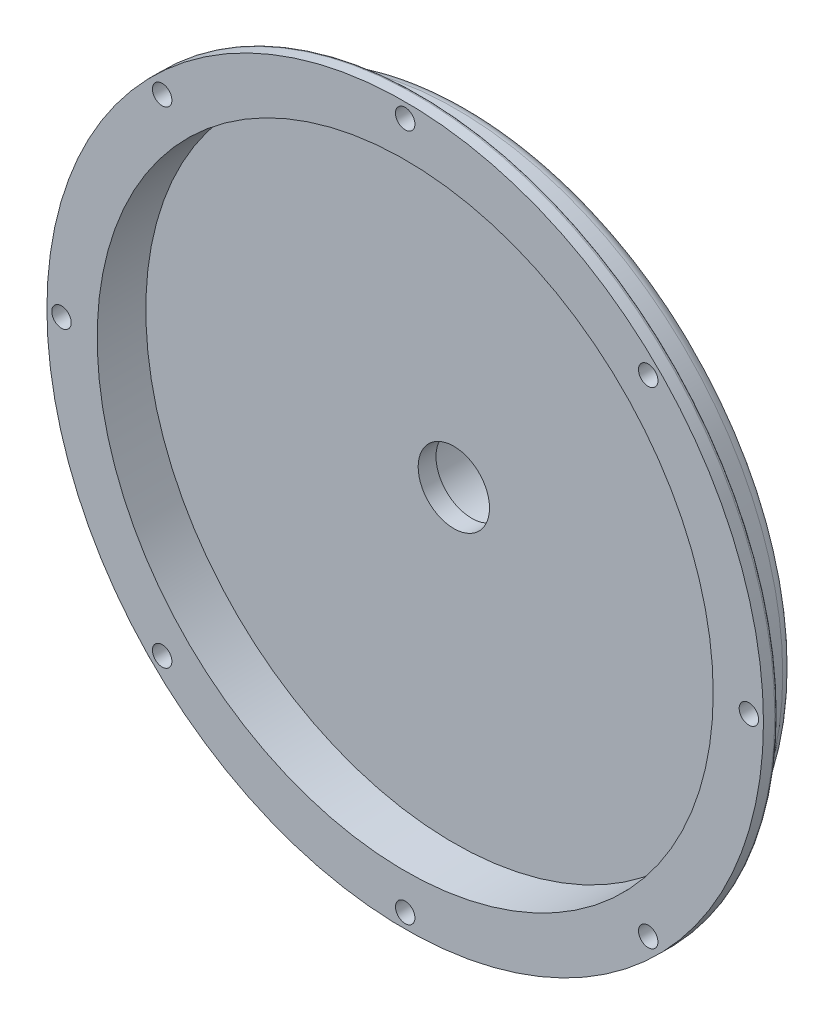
ISO-10303-21;
HEADER;
FILE_DESCRIPTION(('STEP AP214'),'2;1');
FILE_NAME('part.step','',(''),(''),'','','');
FILE_SCHEMA(('AUTOMOTIVE_DESIGN { 1 0 10303 214 1 1 1 1 }'));
ENDSEC;
DATA;
#1=APPLICATION_CONTEXT('core data for automotive mechanical design processes');
#2=APPLICATION_PROTOCOL_DEFINITION('international standard','automotive_design',2000,#1);
#3=PRODUCT_CONTEXT('',#1,'mechanical');
#4=PRODUCT('Part','Part','',(#3));
#5=PRODUCT_RELATED_PRODUCT_CATEGORY('part','',(#4));
#6=PRODUCT_DEFINITION_FORMATION('','',#4);
#7=PRODUCT_DEFINITION_CONTEXT('part definition',#1,'design');
#8=PRODUCT_DEFINITION('design','',#6,#7);
#9=PRODUCT_DEFINITION_SHAPE('','',#8);
#10=(LENGTH_UNIT() NAMED_UNIT(*) SI_UNIT(.MILLI.,.METRE.));
#11=(NAMED_UNIT(*) PLANE_ANGLE_UNIT() SI_UNIT($,.RADIAN.));
#12=(NAMED_UNIT(*) SI_UNIT($,.STERADIAN.) SOLID_ANGLE_UNIT());
#13=UNCERTAINTY_MEASURE_WITH_UNIT(LENGTH_MEASURE(1.E-05),#10,'distance_accuracy_value','');
#14=(GEOMETRIC_REPRESENTATION_CONTEXT(3) GLOBAL_UNCERTAINTY_ASSIGNED_CONTEXT((#13)) GLOBAL_UNIT_ASSIGNED_CONTEXT((#10,
#11,#12)) REPRESENTATION_CONTEXT('',''));
#15=CARTESIAN_POINT('',(0.,0.,0.));
#16=DIRECTION('',(0.,0.,1.));
#17=DIRECTION('',(1.,0.,0.));
#18=AXIS2_PLACEMENT_3D('',#15,#16,#17);
#19=CARTESIAN_POINT('',(0.,0.,-40.));
#20=DIRECTION('',(0.,0.,-1.));
#21=DIRECTION('',(-1.,0.,0.));
#22=AXIS2_PLACEMENT_3D('',#19,#20,#21);
#23=PLANE('',#22);
#24=CARTESIAN_POINT('',(0.,0.,-40.));
#25=DIRECTION('',(0.,0.,-1.));
#26=DIRECTION('',(-1.,0.,0.));
#27=AXIS2_PLACEMENT_3D('',#24,#25,#26);
#28=CIRCLE('',#27,15.);
#29=CARTESIAN_POINT('',(-15.,0.,-40.));
#30=VERTEX_POINT('',#29);
#31=EDGE_CURVE('E134',#30,#30,#28,.T.);
#32=ORIENTED_EDGE('',*,*,#31,.F.);
#33=EDGE_LOOP('',(#32));
#34=FACE_BOUND('',#33,.T.);
#35=CARTESIAN_POINT('',(0.,0.,-40.));
#36=DIRECTION('',(0.,0.,-1.));
#37=DIRECTION('',(-1.,0.,0.));
#38=AXIS2_PLACEMENT_3D('',#35,#36,#37);
#39=CIRCLE('',#38,16.2921591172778);
#40=CARTESIAN_POINT('',(-16.2921591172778,0.,-40.));
#41=VERTEX_POINT('',#40);
#42=EDGE_CURVE('E147',#41,#41,#39,.F.);
#43=ORIENTED_EDGE('',*,*,#42,.F.);
#44=EDGE_LOOP('',(#43));
#45=FACE_BOUND('',#44,.T.);
#46=ADVANCED_FACE('F31',(#34,#45),#23,.T.);
#47=CARTESIAN_POINT('',(0.,0.,-40.));
#48=DIRECTION('',(0.,0.,1.));
#49=DIRECTION('',(1.,0.,0.));
#50=AXIS2_PLACEMENT_3D('',#47,#48,#49);
#51=CYLINDRICAL_SURFACE('',#50,17.);
#52=CARTESIAN_POINT('',(0.,0.,-25.5));
#53=DIRECTION('',(0.,0.,1.));
#54=DIRECTION('',(1.,0.,0.));
#55=AXIS2_PLACEMENT_3D('',#52,#53,#54);
#56=CIRCLE('',#55,17.);
#57=CARTESIAN_POINT('',(17.,0.,-25.5));
#58=VERTEX_POINT('',#57);
#59=EDGE_CURVE('E48',#58,#58,#56,.F.);
#60=CARTESIAN_POINT('',(0.,0.,-27.));
#61=DIRECTION('',(0.,0.,-1.));
#62=DIRECTION('',(-1.,0.,0.));
#63=AXIS2_PLACEMENT_3D('',#60,#61,#62);
#64=CIRCLE('',#63,17.);
#65=CARTESIAN_POINT('',(17.,0.,-27.));
#66=VERTEX_POINT('',#65);
#67=EDGE_CURVE('E10',#66,#66,#64,.T.);
#68=CARTESIAN_POINT('',(17.,0.,-25.5));
#69=CARTESIAN_POINT('',(17.,0.,-25.515625));
#70=CARTESIAN_POINT('',(17.,0.,-25.53125));
#71=CARTESIAN_POINT('',(17.,0.,-25.5625));
#72=CARTESIAN_POINT('',(17.,0.,-25.578125));
#73=CARTESIAN_POINT('',(17.,0.,-25.609375));
#74=CARTESIAN_POINT('',(17.,0.,-25.625));
#75=CARTESIAN_POINT('',(17.,0.,-25.65625));
#76=CARTESIAN_POINT('',(17.,0.,-25.671875));
#77=CARTESIAN_POINT('',(17.,0.,-25.703125));
#78=CARTESIAN_POINT('',(17.,0.,-25.71875));
#79=CARTESIAN_POINT('',(17.,0.,-25.75));
#80=CARTESIAN_POINT('',(17.,0.,-25.765625));
#81=CARTESIAN_POINT('',(17.,0.,-25.796875));
#82=CARTESIAN_POINT('',(17.,0.,-25.8125));
#83=CARTESIAN_POINT('',(17.,0.,-25.84375));
#84=CARTESIAN_POINT('',(17.,0.,-25.859375));
#85=CARTESIAN_POINT('',(17.,0.,-25.890625));
#86=CARTESIAN_POINT('',(17.,0.,-25.90625));
#87=CARTESIAN_POINT('',(17.,0.,-25.9375));
#88=CARTESIAN_POINT('',(17.,0.,-25.953125));
#89=CARTESIAN_POINT('',(17.,0.,-25.984375));
#90=CARTESIAN_POINT('',(17.,0.,-26.));
#91=CARTESIAN_POINT('',(17.,0.,-26.03125));
#92=CARTESIAN_POINT('',(17.,0.,-26.046875));
#93=CARTESIAN_POINT('',(17.,0.,-26.078125));
#94=CARTESIAN_POINT('',(17.,0.,-26.09375));
#95=CARTESIAN_POINT('',(17.,0.,-26.125));
#96=CARTESIAN_POINT('',(17.,0.,-26.140625));
#97=CARTESIAN_POINT('',(17.,0.,-26.171875));
#98=CARTESIAN_POINT('',(17.,0.,-26.1875));
#99=CARTESIAN_POINT('',(17.,0.,-26.21875));
#100=CARTESIAN_POINT('',(17.,0.,-26.234375));
#101=CARTESIAN_POINT('',(17.,0.,-26.265625));
#102=CARTESIAN_POINT('',(17.,0.,-26.28125));
#103=CARTESIAN_POINT('',(17.,0.,-26.3125));
#104=CARTESIAN_POINT('',(17.,0.,-26.328125));
#105=CARTESIAN_POINT('',(17.,0.,-26.359375));
#106=CARTESIAN_POINT('',(17.,0.,-26.375));
#107=CARTESIAN_POINT('',(17.,0.,-26.40625));
#108=CARTESIAN_POINT('',(17.,0.,-26.421875));
#109=CARTESIAN_POINT('',(17.,0.,-26.453125));
#110=CARTESIAN_POINT('',(17.,0.,-26.46875));
#111=CARTESIAN_POINT('',(17.,0.,-26.5));
#112=CARTESIAN_POINT('',(17.,0.,-26.515625));
#113=CARTESIAN_POINT('',(17.,0.,-26.546875));
#114=CARTESIAN_POINT('',(17.,0.,-26.5625));
#115=CARTESIAN_POINT('',(17.,0.,-26.59375));
#116=CARTESIAN_POINT('',(17.,0.,-26.609375));
#117=CARTESIAN_POINT('',(17.,0.,-26.640625));
#118=CARTESIAN_POINT('',(17.,0.,-26.65625));
#119=CARTESIAN_POINT('',(17.,0.,-26.6875));
#120=CARTESIAN_POINT('',(17.,0.,-26.703125));
#121=CARTESIAN_POINT('',(17.,0.,-26.734375));
#122=CARTESIAN_POINT('',(17.,0.,-26.75));
#123=CARTESIAN_POINT('',(17.,0.,-26.78125));
#124=CARTESIAN_POINT('',(17.,0.,-26.796875));
#125=CARTESIAN_POINT('',(17.,0.,-26.828125));
#126=CARTESIAN_POINT('',(17.,0.,-26.84375));
#127=CARTESIAN_POINT('',(17.,0.,-26.875));
#128=CARTESIAN_POINT('',(17.,0.,-26.890625));
#129=CARTESIAN_POINT('',(17.,0.,-26.921875));
#130=CARTESIAN_POINT('',(17.,0.,-26.9375));
#131=CARTESIAN_POINT('',(17.,0.,-26.96875));
#132=CARTESIAN_POINT('',(17.,0.,-26.984375));
#133=CARTESIAN_POINT('',(17.,0.,-27.));
#134=B_SPLINE_CURVE_WITH_KNOTS('',3,(#68,#69,#70,#71,#72,#73,#74,#75,#76,#77,#78,#79,#80,#81,
#82,#83,#84,#85,#86,#87,#88,#89,#90,#91,#92,#93,#94,#95,#96,#97,#98,#99,#100,#101,#102,#103,
#104,#105,#106,#107,#108,#109,#110,#111,#112,#113,#114,#115,#116,#117,#118,#119,#120,#121,#122,
#123,#124,#125,#126,#127,#128,#129,#130,#131,#132,#133),.UNSPECIFIED.,.F.,.F.,(4,2,2,2,2,2,2,2,
2,2,2,2,2,2,2,2,2,2,2,2,2,2,2,2,2,2,2,2,2,2,2,2,4),(0.,0.0468750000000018,0.0937500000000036,
0.140625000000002,0.1875,0.234375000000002,0.281250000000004,0.328125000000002,0.375,
0.421875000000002,0.46875,0.515624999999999,0.5625,0.609375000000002,0.656250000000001,
0.703124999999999,0.750000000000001,0.796875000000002,0.843750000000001,0.890624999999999,
0.937500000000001,0.984375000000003,1.03125,1.078125,1.125,1.171875,1.21875,1.265625,1.3125,
1.359375,1.40625,1.453125,1.5),.UNSPECIFIED.);
#135=EDGE_CURVE('BSEAM170',#58,#66,#134,.T.);
#136=ORIENTED_EDGE('',*,*,#59,.T.);
#137=ORIENTED_EDGE('',*,*,#67,.F.);
#138=ORIENTED_EDGE('',*,*,#135,.T.);
#139=ORIENTED_EDGE('',*,*,#135,.F.);
#140=EDGE_LOOP('',(#136,#138,#137,#139));
#141=FACE_BOUND('',#140,.T.);
#142=ADVANCED_FACE('F170',(#141),#51,.T.);
#143=CARTESIAN_POINT('',(0.,0.,-25.5));
#144=DIRECTION('',(0.,0.,1.));
#145=DIRECTION('',(1.,0.,0.));
#146=AXIS2_PLACEMENT_3D('',#143,#144,#145);
#147=PLANE('',#146);
#148=CARTESIAN_POINT('',(0.,0.,-25.5));
#149=DIRECTION('',(0.,0.,1.));
#150=DIRECTION('',(1.,0.,0.));
#151=AXIS2_PLACEMENT_3D('',#148,#149,#150);
#152=CIRCLE('',#151,25.5);
#153=CARTESIAN_POINT('',(25.5,0.,-25.5));
#154=VERTEX_POINT('',#153);
#155=EDGE_CURVE('E39',#154,#154,#152,.F.);
#156=ORIENTED_EDGE('',*,*,#155,.T.);
#157=EDGE_LOOP('',(#156));
#158=FACE_BOUND('',#157,.T.);
#159=ORIENTED_EDGE('',*,*,#59,.F.);
#160=EDGE_LOOP('',(#159));
#161=FACE_BOUND('',#160,.T.);
#162=ADVANCED_FACE('F178',(#158,#161),#147,.F.);
#163=CARTESIAN_POINT('',(-110.5,0.,0.));
#164=DIRECTION('',(0.,0.,-1.));
#165=DIRECTION('',(-1.,0.,0.));
#166=AXIS2_PLACEMENT_3D('',#163,#164,#165);
#167=PLANE('',#166);
#168=CARTESIAN_POINT('',(0.,0.,0.));
#169=DIRECTION('',(0.,0.,1.));
#170=DIRECTION('',(1.,0.,0.));
#171=AXIS2_PLACEMENT_3D('',#168,#169,#170);
#172=CIRCLE('',#171,95.);
#173=CARTESIAN_POINT('',(95.,0.,0.));
#174=VERTEX_POINT('',#173);
#175=EDGE_CURVE('E52',#174,#174,#172,.T.);
#176=ORIENTED_EDGE('',*,*,#175,.F.);
#177=EDGE_LOOP('',(#176));
#178=FACE_BOUND('',#177,.T.);
#179=CARTESIAN_POINT('',(0.,106.,0.));
#180=DIRECTION('',(0.,0.,1.));
#181=DIRECTION('',(1.,0.,0.));
#182=AXIS2_PLACEMENT_3D('',#179,#180,#181);
#183=CIRCLE('',#182,3.);
#184=CARTESIAN_POINT('',(3.,106.,0.));
#185=VERTEX_POINT('',#184);
#186=EDGE_CURVE('E82',#185,#185,#183,.T.);
#187=ORIENTED_EDGE('',*,*,#186,.F.);
#188=EDGE_LOOP('',(#187));
#189=FACE_BOUND('',#188,.T.);
#190=CARTESIAN_POINT('',(74.9533188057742,74.9533188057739,0.));
#191=DIRECTION('',(0.,0.,1.));
#192=DIRECTION('',(1.,0.,0.));
#193=AXIS2_PLACEMENT_3D('',#190,#191,#192);
#194=CIRCLE('',#193,2.99999999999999);
#195=CARTESIAN_POINT('',(77.9533188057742,74.9533188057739,0.));
#196=VERTEX_POINT('',#195);
#197=EDGE_CURVE('E127',#196,#196,#194,.T.);
#198=ORIENTED_EDGE('',*,*,#197,.F.);
#199=EDGE_LOOP('',(#198));
#200=FACE_BOUND('',#199,.T.);
#201=CARTESIAN_POINT('',(106.,-3.70097021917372E-13,0.));
#202=DIRECTION('',(0.,0.,1.));
#203=DIRECTION('',(1.,0.,0.));
#204=AXIS2_PLACEMENT_3D('',#201,#202,#203);
#205=CIRCLE('',#204,3.);
#206=CARTESIAN_POINT('',(109.,-3.70097021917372E-13,0.));
#207=VERTEX_POINT('',#206);
#208=EDGE_CURVE('E124',#207,#207,#205,.T.);
#209=ORIENTED_EDGE('',*,*,#208,.F.);
#210=EDGE_LOOP('',(#209));
#211=FACE_BOUND('',#210,.T.);
#212=CARTESIAN_POINT('',(74.9533188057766,-74.953318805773,0.));
#213=DIRECTION('',(0.,0.,1.));
#214=DIRECTION('',(1.,0.,0.));
#215=AXIS2_PLACEMENT_3D('',#212,#213,#214);
#216=CIRCLE('',#215,3.00000000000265);
#217=CARTESIAN_POINT('',(77.9533188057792,-74.953318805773,0.));
#218=VERTEX_POINT('',#217);
#219=EDGE_CURVE('E121',#218,#218,#216,.T.);
#220=ORIENTED_EDGE('',*,*,#219,.F.);
#221=EDGE_LOOP('',(#220));
#222=FACE_BOUND('',#221,.T.);
#223=CARTESIAN_POINT('',(2.9867386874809E-12,-106.,0.));
#224=DIRECTION('',(0.,0.,1.));
#225=DIRECTION('',(1.,0.,0.));
#226=AXIS2_PLACEMENT_3D('',#223,#224,#225);
#227=CIRCLE('',#226,3.00000000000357);
#228=CARTESIAN_POINT('',(3.00000000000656,-106.,0.));
#229=VERTEX_POINT('',#228);
#230=EDGE_CURVE('E118',#229,#229,#227,.T.);
#231=ORIENTED_EDGE('',*,*,#230,.F.);
#232=EDGE_LOOP('',(#231));
#233=FACE_BOUND('',#232,.T.);
#234=CARTESIAN_POINT('',(-74.9533188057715,-74.9533188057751,0.));
#235=DIRECTION('',(0.,0.,1.));
#236=DIRECTION('',(1.,0.,0.));
#237=AXIS2_PLACEMENT_3D('',#234,#235,#236);
#238=CIRCLE('',#237,3.00000000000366);
#239=CARTESIAN_POINT('',(-71.9533188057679,-74.9533188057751,0.));
#240=VERTEX_POINT('',#239);
#241=EDGE_CURVE('E115',#240,#240,#238,.T.);
#242=ORIENTED_EDGE('',*,*,#241,.F.);
#243=EDGE_LOOP('',(#242));
#244=FACE_BOUND('',#243,.T.);
#245=CARTESIAN_POINT('',(-105.999999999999,-1.50635059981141E-12,0.));
#246=DIRECTION('',(0.,0.,1.));
#247=DIRECTION('',(1.,0.,0.));
#248=AXIS2_PLACEMENT_3D('',#245,#246,#247);
#249=CIRCLE('',#248,3.00000000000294);
#250=CARTESIAN_POINT('',(-102.999999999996,-1.50635059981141E-12,0.));
#251=VERTEX_POINT('',#250);
#252=EDGE_CURVE('E111',#251,#251,#249,.T.);
#253=ORIENTED_EDGE('',*,*,#252,.F.);
#254=EDGE_LOOP('',(#253));
#255=FACE_BOUND('',#254,.T.);
#256=CARTESIAN_POINT('',(-74.9533188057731,74.953318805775,0.));
#257=DIRECTION('',(0.,0.,1.));
#258=DIRECTION('',(1.,0.,0.));
#259=AXIS2_PLACEMENT_3D('',#256,#257,#258);
#260=CIRCLE('',#259,3.);
#261=CARTESIAN_POINT('',(-71.9533188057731,74.953318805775,0.));
#262=VERTEX_POINT('',#261);
#263=EDGE_CURVE('E108',#262,#262,#260,.T.);
#264=ORIENTED_EDGE('',*,*,#263,.F.);
#265=EDGE_LOOP('',(#264));
#266=FACE_BOUND('',#265,.T.);
#267=CARTESIAN_POINT('',(0.,0.,0.));
#268=DIRECTION('',(0.,0.,1.));
#269=DIRECTION('',(1.,0.,0.));
#270=AXIS2_PLACEMENT_3D('',#267,#268,#269);
#271=CIRCLE('',#270,110.5);
#272=CARTESIAN_POINT('',(110.5,0.,0.));
#273=VERTEX_POINT('',#272);
#274=EDGE_CURVE('E56',#273,#273,#271,.T.);
#275=ORIENTED_EDGE('',*,*,#274,.T.);
#276=EDGE_LOOP('',(#275));
#277=FACE_BOUND('',#276,.T.);
#278=ADVANCED_FACE('F230',(#178,#189,#200,#211,#222,#233,#244,#255,#266,#277),#167,.F.);
#279=CARTESIAN_POINT('',(0.,0.,0.));
#280=DIRECTION('',(0.,0.,1.));
#281=DIRECTION('',(1.,0.,0.));
#282=AXIS2_PLACEMENT_3D('',#279,#280,#281);
#283=CYLINDRICAL_SURFACE('',#282,110.5);
#284=ORIENTED_EDGE('',*,*,#274,.F.);
#285=EDGE_LOOP('',(#284));
#286=FACE_BOUND('',#285,.T.);
#287=CARTESIAN_POINT('',(0.,0.,-3.49999999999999));
#288=DIRECTION('',(0.,0.,1.));
#289=DIRECTION('',(1.,0.,0.));
#290=AXIS2_PLACEMENT_3D('',#287,#288,#289);
#291=CIRCLE('',#290,110.5);
#292=CARTESIAN_POINT('',(110.5,0.,-3.49999999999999));
#293=VERTEX_POINT('',#292);
#294=EDGE_CURVE('E85',#293,#293,#291,.T.);
#295=ORIENTED_EDGE('',*,*,#294,.T.);
#296=EDGE_LOOP('',(#295));
#297=FACE_BOUND('',#296,.T.);
#298=ADVANCED_FACE('F262',(#286,#297),#283,.T.);
#299=CARTESIAN_POINT('',(0.,0.,-3.49999999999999));
#300=DIRECTION('',(0.,0.,1.));
#301=DIRECTION('',(1.,0.,0.));
#302=AXIS2_PLACEMENT_3D('',#299,#300,#301);
#303=TOROIDAL_SURFACE('',#302,109.5,0.99999999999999);
#304=ORIENTED_EDGE('',*,*,#294,.F.);
#305=EDGE_LOOP('',(#304));
#306=FACE_BOUND('',#305,.T.);
#307=CARTESIAN_POINT('',(0.,0.,-4.49999999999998));
#308=DIRECTION('',(0.,0.,1.));
#309=DIRECTION('',(1.,0.,0.));
#310=AXIS2_PLACEMENT_3D('',#307,#308,#309);
#311=CIRCLE('',#310,109.5);
#312=CARTESIAN_POINT('',(109.5,0.,-4.49999999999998));
#313=VERTEX_POINT('',#312);
#314=EDGE_CURVE('E88',#313,#313,#311,.T.);
#315=ORIENTED_EDGE('',*,*,#314,.T.);
#316=EDGE_LOOP('',(#315));
#317=FACE_BOUND('',#316,.T.);
#318=ADVANCED_FACE('F258',(#306,#317),#303,.T.);
#319=CARTESIAN_POINT('',(-102.462834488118,0.,-4.49999999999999));
#320=DIRECTION('',(0.,0.,1.));
#321=DIRECTION('',(1.,0.,0.));
#322=AXIS2_PLACEMENT_3D('',#319,#320,#321);
#323=PLANE('',#322);
#324=CARTESIAN_POINT('',(0.,106.,-4.49999999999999));
#325=DIRECTION('',(0.,0.,1.));
#326=DIRECTION('',(1.,0.,0.));
#327=AXIS2_PLACEMENT_3D('',#324,#325,#326);
#328=CIRCLE('',#327,3.);
#329=CARTESIAN_POINT('',(3.,106.,-4.49999999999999));
#330=VERTEX_POINT('',#329);
#331=EDGE_CURVE('E57',#330,#330,#328,.T.);
#332=ORIENTED_EDGE('',*,*,#331,.T.);
#333=EDGE_LOOP('',(#332));
#334=FACE_BOUND('',#333,.T.);
#335=CARTESIAN_POINT('',(74.9533188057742,74.9533188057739,-4.49999999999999));
#336=DIRECTION('',(0.,0.,1.));
#337=DIRECTION('',(1.,0.,0.));
#338=AXIS2_PLACEMENT_3D('',#335,#336,#337);
#339=CIRCLE('',#338,2.99999999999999);
#340=CARTESIAN_POINT('',(77.9533188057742,74.9533188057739,-4.49999999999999));
#341=VERTEX_POINT('',#340);
#342=EDGE_CURVE('E61',#341,#341,#339,.T.);
#343=ORIENTED_EDGE('',*,*,#342,.T.);
#344=EDGE_LOOP('',(#343));
#345=FACE_BOUND('',#344,.T.);
#346=CARTESIAN_POINT('',(106.,-3.70097021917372E-13,-4.49999999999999));
#347=DIRECTION('',(0.,0.,1.));
#348=DIRECTION('',(1.,0.,0.));
#349=AXIS2_PLACEMENT_3D('',#346,#347,#348);
#350=CIRCLE('',#349,3.);
#351=CARTESIAN_POINT('',(109.,-3.70097021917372E-13,-4.49999999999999));
#352=VERTEX_POINT('',#351);
#353=EDGE_CURVE('E64',#352,#352,#350,.T.);
#354=ORIENTED_EDGE('',*,*,#353,.T.);
#355=EDGE_LOOP('',(#354));
#356=FACE_BOUND('',#355,.T.);
#357=CARTESIAN_POINT('',(74.9533188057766,-74.953318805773,-4.49999999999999));
#358=DIRECTION('',(0.,0.,1.));
#359=DIRECTION('',(1.,0.,0.));
#360=AXIS2_PLACEMENT_3D('',#357,#358,#359);
#361=CIRCLE('',#360,3.00000000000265);
#362=CARTESIAN_POINT('',(77.9533188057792,-74.953318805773,-4.49999999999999));
#363=VERTEX_POINT('',#362);
#364=EDGE_CURVE('E67',#363,#363,#361,.T.);
#365=ORIENTED_EDGE('',*,*,#364,.T.);
#366=EDGE_LOOP('',(#365));
#367=FACE_BOUND('',#366,.T.);
#368=CARTESIAN_POINT('',(2.9867386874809E-12,-106.,-4.49999999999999));
#369=DIRECTION('',(0.,0.,1.));
#370=DIRECTION('',(1.,0.,0.));
#371=AXIS2_PLACEMENT_3D('',#368,#369,#370);
#372=CIRCLE('',#371,3.00000000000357);
#373=CARTESIAN_POINT('',(3.00000000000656,-106.,-4.49999999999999));
#374=VERTEX_POINT('',#373);
#375=EDGE_CURVE('E70',#374,#374,#372,.T.);
#376=ORIENTED_EDGE('',*,*,#375,.T.);
#377=EDGE_LOOP('',(#376));
#378=FACE_BOUND('',#377,.T.);
#379=CARTESIAN_POINT('',(-74.9533188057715,-74.9533188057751,-4.49999999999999));
#380=DIRECTION('',(0.,0.,1.));
#381=DIRECTION('',(1.,0.,0.));
#382=AXIS2_PLACEMENT_3D('',#379,#380,#381);
#383=CIRCLE('',#382,3.00000000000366);
#384=CARTESIAN_POINT('',(-71.9533188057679,-74.9533188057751,-4.49999999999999));
#385=VERTEX_POINT('',#384);
#386=EDGE_CURVE('E73',#385,#385,#383,.T.);
#387=ORIENTED_EDGE('',*,*,#386,.T.);
#388=EDGE_LOOP('',(#387));
#389=FACE_BOUND('',#388,.T.);
#390=CARTESIAN_POINT('',(-105.999999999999,-1.50635059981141E-12,-4.49999999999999));
#391=DIRECTION('',(0.,0.,1.));
#392=DIRECTION('',(1.,0.,0.));
#393=AXIS2_PLACEMENT_3D('',#390,#391,#392);
#394=CIRCLE('',#393,3.00000000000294);
#395=CARTESIAN_POINT('',(-102.999999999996,-1.50635059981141E-12,-4.49999999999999));
#396=VERTEX_POINT('',#395);
#397=EDGE_CURVE('E76',#396,#396,#394,.T.);
#398=ORIENTED_EDGE('',*,*,#397,.T.);
#399=EDGE_LOOP('',(#398));
#400=FACE_BOUND('',#399,.T.);
#401=CARTESIAN_POINT('',(-74.9533188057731,74.953318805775,-4.49999999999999));
#402=DIRECTION('',(0.,0.,1.));
#403=DIRECTION('',(1.,0.,0.));
#404=AXIS2_PLACEMENT_3D('',#401,#402,#403);
#405=CIRCLE('',#404,3.);
#406=CARTESIAN_POINT('',(-71.9533188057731,74.953318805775,-4.49999999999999));
#407=VERTEX_POINT('',#406);
#408=EDGE_CURVE('E79',#407,#407,#405,.T.);
#409=ORIENTED_EDGE('',*,*,#408,.T.);
#410=EDGE_LOOP('',(#409));
#411=FACE_BOUND('',#410,.T.);
#412=ORIENTED_EDGE('',*,*,#314,.F.);
#413=EDGE_LOOP('',(#412));
#414=FACE_BOUND('',#413,.T.);
#415=CARTESIAN_POINT('',(0.,0.,-4.5));
#416=DIRECTION('',(0.,0.,1.));
#417=DIRECTION('',(1.,0.,0.));
#418=AXIS2_PLACEMENT_3D('',#415,#416,#417);
#419=CIRCLE('',#418,102.462834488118);
#420=CARTESIAN_POINT('',(102.462834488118,0.,-4.5));
#421=VERTEX_POINT('',#420);
#422=EDGE_CURVE('E91',#421,#421,#419,.T.);
#423=ORIENTED_EDGE('',*,*,#422,.T.);
#424=EDGE_LOOP('',(#423));
#425=FACE_BOUND('',#424,.T.);
#426=ADVANCED_FACE('F254',(#334,#345,#356,#367,#378,#389,#400,#411,#414,#425),#323,.F.);
#427=CARTESIAN_POINT('',(0.,0.,-5.5));
#428=DIRECTION('',(0.,0.,1.));
#429=DIRECTION('',(1.,0.,0.));
#430=AXIS2_PLACEMENT_3D('',#427,#428,#429);
#431=TOROIDAL_SURFACE('',#430,102.462834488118,0.999999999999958);
#432=ORIENTED_EDGE('',*,*,#422,.F.);
#433=EDGE_LOOP('',(#432));
#434=FACE_BOUND('',#433,.T.);
#435=CARTESIAN_POINT('',(0.,0.,-5.41940457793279));
#436=DIRECTION('',(0.,0.,1.));
#437=DIRECTION('',(1.,0.,0.));
#438=AXIS2_PLACEMENT_3D('',#435,#436,#437);
#439=CIRCLE('',#438,101.466087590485);
#440=CARTESIAN_POINT('',(101.466087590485,0.,-5.41940457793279));
#441=VERTEX_POINT('',#440);
#442=EDGE_CURVE('E94',#441,#441,#439,.T.);
#443=ORIENTED_EDGE('',*,*,#442,.T.);
#444=EDGE_LOOP('',(#443));
#445=FACE_BOUND('',#444,.T.);
#446=ADVANCED_FACE('F250',(#434,#445),#431,.F.);
#447=CARTESIAN_POINT('',(0.,0.,-15.8223816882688));
#448=DIRECTION('',(0.,0.,1.));
#449=DIRECTION('',(1.,0.,0.));
#450=AXIS2_PLACEMENT_3D('',#447,#448,#449);
#451=CONICAL_SURFACE('',#450,100.624918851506,0.080682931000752);
#452=ORIENTED_EDGE('',*,*,#442,.F.);
#453=EDGE_LOOP('',(#452));
#454=FACE_BOUND('',#453,.T.);
#455=CARTESIAN_POINT('',(0.,0.,-15.8223816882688));
#456=DIRECTION('',(0.,0.,1.));
#457=DIRECTION('',(1.,0.,0.));
#458=AXIS2_PLACEMENT_3D('',#455,#456,#457);
#459=CIRCLE('',#458,100.624918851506);
#460=CARTESIAN_POINT('',(100.624918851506,0.,-15.8223816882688));
#461=VERTEX_POINT('',#460);
#462=EDGE_CURVE('E97',#461,#461,#459,.T.);
#463=ORIENTED_EDGE('',*,*,#462,.T.);
#464=EDGE_LOOP('',(#463));
#465=FACE_BOUND('',#464,.T.);
#466=ADVANCED_FACE('F246',(#454,#465),#451,.T.);
#467=CARTESIAN_POINT('',(0.,0.,-15.5));
#468=DIRECTION('',(0.,0.,1.));
#469=DIRECTION('',(1.,0.,0.));
#470=AXIS2_PLACEMENT_3D('',#467,#468,#469);
#471=TOROIDAL_SURFACE('',#470,96.6379312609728,4.);
#472=ORIENTED_EDGE('',*,*,#462,.F.);
#473=EDGE_LOOP('',(#472));
#474=FACE_BOUND('',#473,.T.);
#475=CARTESIAN_POINT('',(0.,0.,-19.5));
#476=DIRECTION('',(0.,0.,1.));
#477=DIRECTION('',(1.,0.,0.));
#478=AXIS2_PLACEMENT_3D('',#475,#476,#477);
#479=CIRCLE('',#478,96.6379312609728);
#480=CARTESIAN_POINT('',(96.6379312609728,0.,-19.5));
#481=VERTEX_POINT('',#480);
#482=EDGE_CURVE('E100',#481,#481,#479,.T.);
#483=ORIENTED_EDGE('',*,*,#482,.T.);
#484=EDGE_LOOP('',(#483));
#485=FACE_BOUND('',#484,.T.);
#486=ADVANCED_FACE('F242',(#474,#485),#471,.T.);
#487=CARTESIAN_POINT('',(-96.6379312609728,0.,-19.5));
#488=DIRECTION('',(0.,0.,1.));
#489=DIRECTION('',(1.,0.,0.));
#490=AXIS2_PLACEMENT_3D('',#487,#488,#489);
#491=PLANE('',#490);
#492=ORIENTED_EDGE('',*,*,#482,.F.);
#493=EDGE_LOOP('',(#492));
#494=FACE_BOUND('',#493,.T.);
#495=CARTESIAN_POINT('',(0.,0.,-19.5));
#496=DIRECTION('',(0.,0.,1.));
#497=DIRECTION('',(1.,0.,0.));
#498=AXIS2_PLACEMENT_3D('',#495,#496,#497);
#499=CIRCLE('',#498,29.5);
#500=CARTESIAN_POINT('',(29.5,0.,-19.5));
#501=VERTEX_POINT('',#500);
#502=EDGE_CURVE('E103',#501,#501,#499,.T.);
#503=ORIENTED_EDGE('',*,*,#502,.T.);
#504=EDGE_LOOP('',(#503));
#505=FACE_BOUND('',#504,.T.);
#506=ADVANCED_FACE('F238',(#494,#505),#491,.F.);
#507=CARTESIAN_POINT('',(0.,0.,-22.5));
#508=DIRECTION('',(0.,0.,1.));
#509=DIRECTION('',(1.,0.,0.));
#510=AXIS2_PLACEMENT_3D('',#507,#508,#509);
#511=TOROIDAL_SURFACE('',#510,29.5,3.);
#512=ORIENTED_EDGE('',*,*,#502,.F.);
#513=EDGE_LOOP('',(#512));
#514=FACE_BOUND('',#513,.T.);
#515=CARTESIAN_POINT('',(0.,0.,-22.5));
#516=DIRECTION('',(0.,0.,1.));
#517=DIRECTION('',(1.,0.,0.));
#518=AXIS2_PLACEMENT_3D('',#515,#516,#517);
#519=CIRCLE('',#518,26.5);
#520=CARTESIAN_POINT('',(26.5,0.,-22.5));
#521=VERTEX_POINT('',#520);
#522=EDGE_CURVE('E60',#521,#521,#519,.T.);
#523=ORIENTED_EDGE('',*,*,#522,.T.);
#524=EDGE_LOOP('',(#523));
#525=FACE_BOUND('',#524,.T.);
#526=ADVANCED_FACE('F234',(#514,#525),#511,.F.);
#527=CARTESIAN_POINT('',(0.,0.,0.));
#528=DIRECTION('',(0.,0.,1.));
#529=DIRECTION('',(1.,0.,0.));
#530=AXIS2_PLACEMENT_3D('',#527,#528,#529);
#531=CYLINDRICAL_SURFACE('',#530,26.5);
#532=CARTESIAN_POINT('',(0.,0.,-24.5));
#533=DIRECTION('',(0.,0.,1.));
#534=DIRECTION('',(1.,0.,0.));
#535=AXIS2_PLACEMENT_3D('',#532,#533,#534);
#536=CIRCLE('',#535,26.5);
#537=CARTESIAN_POINT('',(26.5,0.,-24.5));
#538=VERTEX_POINT('',#537);
#539=EDGE_CURVE('E43',#538,#538,#536,.T.);
#540=ORIENTED_EDGE('',*,*,#539,.T.);
#541=EDGE_LOOP('',(#540));
#542=FACE_BOUND('',#541,.T.);
#543=ORIENTED_EDGE('',*,*,#522,.F.);
#544=EDGE_LOOP('',(#543));
#545=FACE_BOUND('',#544,.T.);
#546=ADVANCED_FACE('F226',(#542,#545),#531,.T.);
#547=CARTESIAN_POINT('',(-74.9533188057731,74.953318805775,-10.));
#548=DIRECTION('',(0.,0.,1.));
#549=DIRECTION('',(1.,0.,0.));
#550=AXIS2_PLACEMENT_3D('',#547,#548,#549);
#551=CYLINDRICAL_SURFACE('',#550,3.);
#552=ORIENTED_EDGE('',*,*,#263,.T.);
#553=EDGE_LOOP('',(#552));
#554=FACE_BOUND('',#553,.T.);
#555=ORIENTED_EDGE('',*,*,#408,.F.);
#556=EDGE_LOOP('',(#555));
#557=FACE_BOUND('',#556,.T.);
#558=ADVANCED_FACE('F222',(#554,#557),#551,.F.);
#559=CARTESIAN_POINT('',(-105.999999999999,-1.50635059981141E-12,-10.));
#560=DIRECTION('',(0.,0.,1.));
#561=DIRECTION('',(1.,0.,0.));
#562=AXIS2_PLACEMENT_3D('',#559,#560,#561);
#563=CYLINDRICAL_SURFACE('',#562,3.00000000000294);
#564=ORIENTED_EDGE('',*,*,#252,.T.);
#565=EDGE_LOOP('',(#564));
#566=FACE_BOUND('',#565,.T.);
#567=ORIENTED_EDGE('',*,*,#397,.F.);
#568=EDGE_LOOP('',(#567));
#569=FACE_BOUND('',#568,.T.);
#570=ADVANCED_FACE('F218',(#566,#569),#563,.F.);
#571=CARTESIAN_POINT('',(-74.9533188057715,-74.9533188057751,-10.));
#572=DIRECTION('',(0.,0.,1.));
#573=DIRECTION('',(1.,0.,0.));
#574=AXIS2_PLACEMENT_3D('',#571,#572,#573);
#575=CYLINDRICAL_SURFACE('',#574,3.00000000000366);
#576=ORIENTED_EDGE('',*,*,#241,.T.);
#577=EDGE_LOOP('',(#576));
#578=FACE_BOUND('',#577,.T.);
#579=ORIENTED_EDGE('',*,*,#386,.F.);
#580=EDGE_LOOP('',(#579));
#581=FACE_BOUND('',#580,.T.);
#582=ADVANCED_FACE('F214',(#578,#581),#575,.F.);
#583=CARTESIAN_POINT('',(2.9867386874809E-12,-106.,-10.));
#584=DIRECTION('',(0.,0.,1.));
#585=DIRECTION('',(1.,0.,0.));
#586=AXIS2_PLACEMENT_3D('',#583,#584,#585);
#587=CYLINDRICAL_SURFACE('',#586,3.00000000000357);
#588=ORIENTED_EDGE('',*,*,#230,.T.);
#589=EDGE_LOOP('',(#588));
#590=FACE_BOUND('',#589,.T.);
#591=ORIENTED_EDGE('',*,*,#375,.F.);
#592=EDGE_LOOP('',(#591));
#593=FACE_BOUND('',#592,.T.);
#594=ADVANCED_FACE('F210',(#590,#593),#587,.F.);
#595=CARTESIAN_POINT('',(74.9533188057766,-74.953318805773,-10.));
#596=DIRECTION('',(0.,0.,1.));
#597=DIRECTION('',(1.,0.,0.));
#598=AXIS2_PLACEMENT_3D('',#595,#596,#597);
#599=CYLINDRICAL_SURFACE('',#598,3.00000000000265);
#600=ORIENTED_EDGE('',*,*,#219,.T.);
#601=EDGE_LOOP('',(#600));
#602=FACE_BOUND('',#601,.T.);
#603=ORIENTED_EDGE('',*,*,#364,.F.);
#604=EDGE_LOOP('',(#603));
#605=FACE_BOUND('',#604,.T.);
#606=ADVANCED_FACE('F206',(#602,#605),#599,.F.);
#607=CARTESIAN_POINT('',(106.,-3.70097021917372E-13,-10.));
#608=DIRECTION('',(0.,0.,1.));
#609=DIRECTION('',(1.,0.,0.));
#610=AXIS2_PLACEMENT_3D('',#607,#608,#609);
#611=CYLINDRICAL_SURFACE('',#610,3.);
#612=ORIENTED_EDGE('',*,*,#208,.T.);
#613=EDGE_LOOP('',(#612));
#614=FACE_BOUND('',#613,.T.);
#615=ORIENTED_EDGE('',*,*,#353,.F.);
#616=EDGE_LOOP('',(#615));
#617=FACE_BOUND('',#616,.T.);
#618=ADVANCED_FACE('F202',(#614,#617),#611,.F.);
#619=CARTESIAN_POINT('',(74.9533188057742,74.9533188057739,-10.));
#620=DIRECTION('',(0.,0.,1.));
#621=DIRECTION('',(1.,0.,0.));
#622=AXIS2_PLACEMENT_3D('',#619,#620,#621);
#623=CYLINDRICAL_SURFACE('',#622,2.99999999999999);
#624=ORIENTED_EDGE('',*,*,#197,.T.);
#625=EDGE_LOOP('',(#624));
#626=FACE_BOUND('',#625,.T.);
#627=ORIENTED_EDGE('',*,*,#342,.F.);
#628=EDGE_LOOP('',(#627));
#629=FACE_BOUND('',#628,.T.);
#630=ADVANCED_FACE('F198',(#626,#629),#623,.F.);
#631=CARTESIAN_POINT('',(0.,106.,-10.));
#632=DIRECTION('',(0.,0.,1.));
#633=DIRECTION('',(1.,0.,0.));
#634=AXIS2_PLACEMENT_3D('',#631,#632,#633);
#635=CYLINDRICAL_SURFACE('',#634,3.);
#636=ORIENTED_EDGE('',*,*,#186,.T.);
#637=EDGE_LOOP('',(#636));
#638=FACE_BOUND('',#637,.T.);
#639=ORIENTED_EDGE('',*,*,#331,.F.);
#640=EDGE_LOOP('',(#639));
#641=FACE_BOUND('',#640,.T.);
#642=ADVANCED_FACE('F191',(#638,#641),#635,.F.);
#643=CARTESIAN_POINT('',(0.,0.,-20.5));
#644=DIRECTION('',(0.,0.,1.));
#645=DIRECTION('',(1.,0.,0.));
#646=AXIS2_PLACEMENT_3D('',#643,#644,#645);
#647=PLANE('',#646);
#648=CARTESIAN_POINT('',(0.,0.,-20.5));
#649=DIRECTION('',(0.,0.,-1.));
#650=DIRECTION('',(-1.,0.,0.));
#651=AXIS2_PLACEMENT_3D('',#648,#649,#650);
#652=CIRCLE('',#651,11.);
#653=CARTESIAN_POINT('',(-11.,0.,-20.5));
#654=VERTEX_POINT('',#653);
#655=EDGE_CURVE('E53',#654,#654,#652,.T.);
#656=ORIENTED_EDGE('',*,*,#655,.F.);
#657=EDGE_LOOP('',(#656));
#658=FACE_BOUND('',#657,.T.);
#659=CARTESIAN_POINT('',(0.,0.,-20.5));
#660=DIRECTION('',(0.,0.,1.));
#661=DIRECTION('',(1.,0.,0.));
#662=AXIS2_PLACEMENT_3D('',#659,#660,#661);
#663=CIRCLE('',#662,15.);
#664=CARTESIAN_POINT('',(15.,0.,-20.5));
#665=VERTEX_POINT('',#664);
#666=EDGE_CURVE('E112',#665,#665,#663,.T.);
#667=ORIENTED_EDGE('',*,*,#666,.F.);
#668=EDGE_LOOP('',(#667));
#669=FACE_BOUND('',#668,.T.);
#670=ADVANCED_FACE('F187',(#658,#669),#647,.F.);
#671=CARTESIAN_POINT('',(0.,0.,-20.5));
#672=DIRECTION('',(0.,0.,-1.));
#673=DIRECTION('',(-1.,0.,0.));
#674=AXIS2_PLACEMENT_3D('',#671,#672,#673);
#675=CYLINDRICAL_SURFACE('',#674,15.);
#676=ORIENTED_EDGE('',*,*,#666,.T.);
#677=EDGE_LOOP('',(#676));
#678=FACE_BOUND('',#677,.T.);
#679=ORIENTED_EDGE('',*,*,#31,.T.);
#680=EDGE_LOOP('',(#679));
#681=FACE_BOUND('',#680,.T.);
#682=ADVANCED_FACE('F190',(#678,#681),#675,.F.);
#683=CARTESIAN_POINT('',(0.,0.,-15.));
#684=DIRECTION('',(0.,0.,1.));
#685=DIRECTION('',(1.,0.,0.));
#686=AXIS2_PLACEMENT_3D('',#683,#684,#685);
#687=CYLINDRICAL_SURFACE('',#686,95.);
#688=CARTESIAN_POINT('',(0.,0.,-15.));
#689=DIRECTION('',(0.,0.,1.));
#690=DIRECTION('',(1.,0.,0.));
#691=AXIS2_PLACEMENT_3D('',#688,#689,#690);
#692=CIRCLE('',#691,95.);
#693=CARTESIAN_POINT('',(95.,0.,-15.));
#694=VERTEX_POINT('',#693);
#695=EDGE_CURVE('E137',#694,#694,#692,.T.);
#696=ORIENTED_EDGE('',*,*,#695,.F.);
#697=EDGE_LOOP('',(#696));
#698=FACE_BOUND('',#697,.T.);
#699=ORIENTED_EDGE('',*,*,#175,.T.);
#700=EDGE_LOOP('',(#699));
#701=FACE_BOUND('',#700,.T.);
#702=ADVANCED_FACE('F184',(#698,#701),#687,.F.);
#703=CARTESIAN_POINT('',(0.,0.,-15.));
#704=DIRECTION('',(0.,0.,1.));
#705=DIRECTION('',(1.,0.,0.));
#706=AXIS2_PLACEMENT_3D('',#703,#704,#705);
#707=PLANE('',#706);
#708=CARTESIAN_POINT('',(0.,0.,-15.));
#709=DIRECTION('',(0.,0.,1.));
#710=DIRECTION('',(1.,0.,0.));
#711=AXIS2_PLACEMENT_3D('',#708,#709,#710);
#712=CIRCLE('',#711,11.);
#713=CARTESIAN_POINT('',(11.,0.,-15.));
#714=VERTEX_POINT('',#713);
#715=EDGE_CURVE('E49',#714,#714,#712,.T.);
#716=ORIENTED_EDGE('',*,*,#715,.F.);
#717=EDGE_LOOP('',(#716));
#718=FACE_BOUND('',#717,.T.);
#719=ORIENTED_EDGE('',*,*,#695,.T.);
#720=EDGE_LOOP('',(#719));
#721=FACE_BOUND('',#720,.T.);
#722=ADVANCED_FACE('F333',(#718,#721),#707,.T.);
#723=CARTESIAN_POINT('',(0.,0.,-5.49999999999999));
#724=DIRECTION('',(0.,0.,-1.));
#725=DIRECTION('',(-1.,0.,0.));
#726=AXIS2_PLACEMENT_3D('',#723,#724,#725);
#727=CYLINDRICAL_SURFACE('',#726,11.);
#728=ORIENTED_EDGE('',*,*,#715,.T.);
#729=EDGE_LOOP('',(#728));
#730=FACE_BOUND('',#729,.T.);
#731=ORIENTED_EDGE('',*,*,#655,.T.);
#732=EDGE_LOOP('',(#731));
#733=FACE_BOUND('',#732,.T.);
#734=ADVANCED_FACE('F338',(#730,#733),#727,.F.);
#735=CARTESIAN_POINT('',(0.,0.,-24.5));
#736=DIRECTION('',(0.,0.,1.));
#737=DIRECTION('',(1.,0.,0.));
#738=AXIS2_PLACEMENT_3D('',#735,#736,#737);
#739=TOROIDAL_SURFACE('',#738,25.5,1.);
#740=ORIENTED_EDGE('',*,*,#155,.F.);
#741=EDGE_LOOP('',(#740));
#742=FACE_BOUND('',#741,.T.);
#743=ORIENTED_EDGE('',*,*,#539,.F.);
#744=EDGE_LOOP('',(#743));
#745=FACE_BOUND('',#744,.T.);
#746=ADVANCED_FACE('F33',(#742,#745),#739,.T.);
#747=CARTESIAN_POINT('',(0.,0.,-27.));
#748=DIRECTION('',(0.,0.,-1.));
#749=DIRECTION('',(-1.,0.,0.));
#750=AXIS2_PLACEMENT_3D('',#747,#748,#749);
#751=CYLINDRICAL_SURFACE('',#750,17.75);
#752=CARTESIAN_POINT('',(0.,0.,-38.9755712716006));
#753=DIRECTION('',(0.,0.,1.));
#754=DIRECTION('',(1.,0.,0.));
#755=AXIS2_PLACEMENT_3D('',#752,#753,#754);
#756=CIRCLE('',#755,17.75);
#757=CARTESIAN_POINT('',(-17.75,0.,-38.9755712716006));
#758=VERTEX_POINT('',#757);
#759=EDGE_CURVE('E35',#758,#758,#756,.F.);
#760=CARTESIAN_POINT('',(0.,0.,-27.));
#761=DIRECTION('',(0.,0.,-1.));
#762=DIRECTION('',(-1.,0.,0.));
#763=AXIS2_PLACEMENT_3D('',#760,#761,#762);
#764=CIRCLE('',#763,17.75);
#765=CARTESIAN_POINT('',(-17.75,0.,-27.));
#766=VERTEX_POINT('',#765);
#767=EDGE_CURVE('E144',#766,#766,#764,.T.);
#768=CARTESIAN_POINT('',(-17.75,0.,-38.9755712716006));
#769=CARTESIAN_POINT('',(-17.75,0.,-38.8508257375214));
#770=CARTESIAN_POINT('',(-17.75,0.,-38.7260802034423));
#771=CARTESIAN_POINT('',(-17.75,0.,-38.4765891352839));
#772=CARTESIAN_POINT('',(-17.75,0.,-38.3518436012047));
#773=CARTESIAN_POINT('',(-17.75,0.,-38.1023525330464));
#774=CARTESIAN_POINT('',(-17.75,0.,-37.9776069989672));
#775=CARTESIAN_POINT('',(-17.75,0.,-37.7281159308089));
#776=CARTESIAN_POINT('',(-17.75,0.,-37.6033703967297));
#777=CARTESIAN_POINT('',(-17.75,0.,-37.3538793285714));
#778=CARTESIAN_POINT('',(-17.75,0.,-37.2291337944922));
#779=CARTESIAN_POINT('',(-17.75,0.,-36.9796427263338));
#780=CARTESIAN_POINT('',(-17.75,0.,-36.8548971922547));
#781=CARTESIAN_POINT('',(-17.75,0.,-36.6054061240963));
#782=CARTESIAN_POINT('',(-17.75,0.,-36.4806605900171));
#783=CARTESIAN_POINT('',(-17.75,0.,-36.2311695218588));
#784=CARTESIAN_POINT('',(-17.75,0.,-36.1064239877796));
#785=CARTESIAN_POINT('',(-17.75,0.,-35.8569329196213));
#786=CARTESIAN_POINT('',(-17.75,0.,-35.7321873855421));
#787=CARTESIAN_POINT('',(-17.75,0.,-35.4826963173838));
#788=CARTESIAN_POINT('',(-17.75,0.,-35.3579507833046));
#789=CARTESIAN_POINT('',(-17.75,0.,-35.1084597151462));
#790=CARTESIAN_POINT('',(-17.75,0.,-34.9837141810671));
#791=CARTESIAN_POINT('',(-17.75,0.,-34.7342231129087));
#792=CARTESIAN_POINT('',(-17.75,0.,-34.6094775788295));
#793=CARTESIAN_POINT('',(-17.75,0.,-34.3599865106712));
#794=CARTESIAN_POINT('',(-17.75,0.,-34.235240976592));
#795=CARTESIAN_POINT('',(-17.75,0.,-33.9857499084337));
#796=CARTESIAN_POINT('',(-17.75,0.,-33.8610043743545));
#797=CARTESIAN_POINT('',(-17.75,0.,-33.6115133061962));
#798=CARTESIAN_POINT('',(-17.75,0.,-33.486767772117));
#799=CARTESIAN_POINT('',(-17.75,0.,-33.2372767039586));
#800=CARTESIAN_POINT('',(-17.75,0.,-33.1125311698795));
#801=CARTESIAN_POINT('',(-17.75,0.,-32.8630401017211));
#802=CARTESIAN_POINT('',(-17.75,0.,-32.738294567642));
#803=CARTESIAN_POINT('',(-17.75,0.,-32.4888034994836));
#804=CARTESIAN_POINT('',(-17.75,0.,-32.3640579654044));
#805=CARTESIAN_POINT('',(-17.75,0.,-32.1145668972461));
#806=CARTESIAN_POINT('',(-17.75,0.,-31.9898213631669));
#807=CARTESIAN_POINT('',(-17.75,0.,-31.7403302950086));
#808=CARTESIAN_POINT('',(-17.75,0.,-31.6155847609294));
#809=CARTESIAN_POINT('',(-17.75,0.,-31.366093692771));
#810=CARTESIAN_POINT('',(-17.75,0.,-31.2413481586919));
#811=CARTESIAN_POINT('',(-17.75,0.,-30.9918570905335));
#812=CARTESIAN_POINT('',(-17.75,0.,-30.8671115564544));
#813=CARTESIAN_POINT('',(-17.75,0.,-30.617620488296));
#814=CARTESIAN_POINT('',(-17.75,0.,-30.4928749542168));
#815=CARTESIAN_POINT('',(-17.75,0.,-30.2433838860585));
#816=CARTESIAN_POINT('',(-17.75,0.,-30.1186383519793));
#817=CARTESIAN_POINT('',(-17.75,0.,-29.869147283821));
#818=CARTESIAN_POINT('',(-17.75,0.,-29.7444017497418));
#819=CARTESIAN_POINT('',(-17.75,0.,-29.4949106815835));
#820=CARTESIAN_POINT('',(-17.75,0.,-29.3701651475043));
#821=CARTESIAN_POINT('',(-17.75,0.,-29.1206740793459));
#822=CARTESIAN_POINT('',(-17.75,0.,-28.9959285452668));
#823=CARTESIAN_POINT('',(-17.75,0.,-28.7464374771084));
#824=CARTESIAN_POINT('',(-17.75,0.,-28.6216919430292));
#825=CARTESIAN_POINT('',(-17.75,0.,-28.3722008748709));
#826=CARTESIAN_POINT('',(-17.75,0.,-28.2474553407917));
#827=CARTESIAN_POINT('',(-17.75,0.,-27.9979642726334));
#828=CARTESIAN_POINT('',(-17.75,0.,-27.8732187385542));
#829=CARTESIAN_POINT('',(-17.75,0.,-27.6237276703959));
#830=CARTESIAN_POINT('',(-17.75,0.,-27.4989821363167));
#831=CARTESIAN_POINT('',(-17.75,0.,-27.2494910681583));
#832=CARTESIAN_POINT('',(-17.75,0.,-27.1247455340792));
#833=CARTESIAN_POINT('',(-17.75,0.,-27.));
#834=B_SPLINE_CURVE_WITH_KNOTS('',3,(#768,#769,#770,#771,#772,#773,#774,#775,#776,#777,#778,
#779,#780,#781,#782,#783,#784,#785,#786,#787,#788,#789,#790,#791,#792,#793,#794,#795,#796,#797,
#798,#799,#800,#801,#802,#803,#804,#805,#806,#807,#808,#809,#810,#811,#812,#813,#814,#815,#816,
#817,#818,#819,#820,#821,#822,#823,#824,#825,#826,#827,#828,#829,#830,#831,#832,#833),
.UNSPECIFIED.,.F.,.F.,(4,2,2,2,2,2,2,2,2,2,2,2,2,2,2,2,2,2,2,2,2,2,2,2,2,2,2,2,2,2,2,2,4),(0.,
0.374236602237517,0.748473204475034,1.12270980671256,1.49694640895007,1.87118301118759,
2.24541961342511,2.61965621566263,2.99389281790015,3.36812942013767,3.74236602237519,
4.11660262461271,4.49083922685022,4.86507582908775,5.23931243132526,5.61354903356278,
5.9877856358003,6.36202223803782,6.73625884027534,7.11049544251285,7.48473204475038,
7.85896864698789,8.23320524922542,8.60744185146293,8.98167845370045,9.35591505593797,
9.73015165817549,10.104388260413,10.4786248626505,10.852861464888,11.2270980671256,
11.6013346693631,11.9755712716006),.UNSPECIFIED.);
#835=EDGE_CURVE('BSEAM156',#758,#766,#834,.T.);
#836=ORIENTED_EDGE('',*,*,#759,.F.);
#837=ORIENTED_EDGE('',*,*,#767,.T.);
#838=ORIENTED_EDGE('',*,*,#835,.T.);
#839=ORIENTED_EDGE('',*,*,#835,.F.);
#840=EDGE_LOOP('',(#836,#838,#837,#839));
#841=FACE_BOUND('',#840,.T.);
#842=ADVANCED_FACE('F156',(#841),#751,.T.);
#843=CARTESIAN_POINT('',(0.,0.,-27.));
#844=DIRECTION('',(0.,0.,-1.));
#845=DIRECTION('',(-1.,0.,0.));
#846=AXIS2_PLACEMENT_3D('',#843,#844,#845);
#847=PLANE('',#846);
#848=ORIENTED_EDGE('',*,*,#67,.T.);
#849=EDGE_LOOP('',(#848));
#850=FACE_BOUND('',#849,.T.);
#851=ORIENTED_EDGE('',*,*,#767,.F.);
#852=EDGE_LOOP('',(#851));
#853=FACE_BOUND('',#852,.T.);
#854=ADVANCED_FACE('F159',(#850,#853),#847,.F.);
#855=CARTESIAN_POINT('',(0.,0.,-38.7746465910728));
#856=DIRECTION('',(0.,0.,1.));
#857=DIRECTION('',(1.,0.,0.));
#858=AXIS2_PLACEMENT_3D('',#855,#856,#857);
#859=CONICAL_SURFACE('',#858,18.0359312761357,0.958258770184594);
#860=ORIENTED_EDGE('',*,*,#42,.T.);
#861=EDGE_LOOP('',(#860));
#862=FACE_BOUND('',#861,.T.);
#863=ORIENTED_EDGE('',*,*,#759,.T.);
#864=EDGE_LOOP('',(#863));
#865=FACE_BOUND('',#864,.T.);
#866=ADVANCED_FACE('F154',(#862,#865),#859,.T.);
#867=CLOSED_SHELL('',(#46,#142,#162,#278,#298,#318,#426,#446,#466,#486,#506,#526,#546,#558,#570,
#582,#594,#606,#618,#630,#642,#670,#682,#702,#722,#734,#746,#842,#854,#866));
#868=MANIFOLD_SOLID_BREP('B2',#867);
#869=ADVANCED_BREP_SHAPE_REPRESENTATION('',(#18,#868),#14);
#870=SHAPE_DEFINITION_REPRESENTATION(#9,#869);
ENDSEC;
END-ISO-10303-21;
